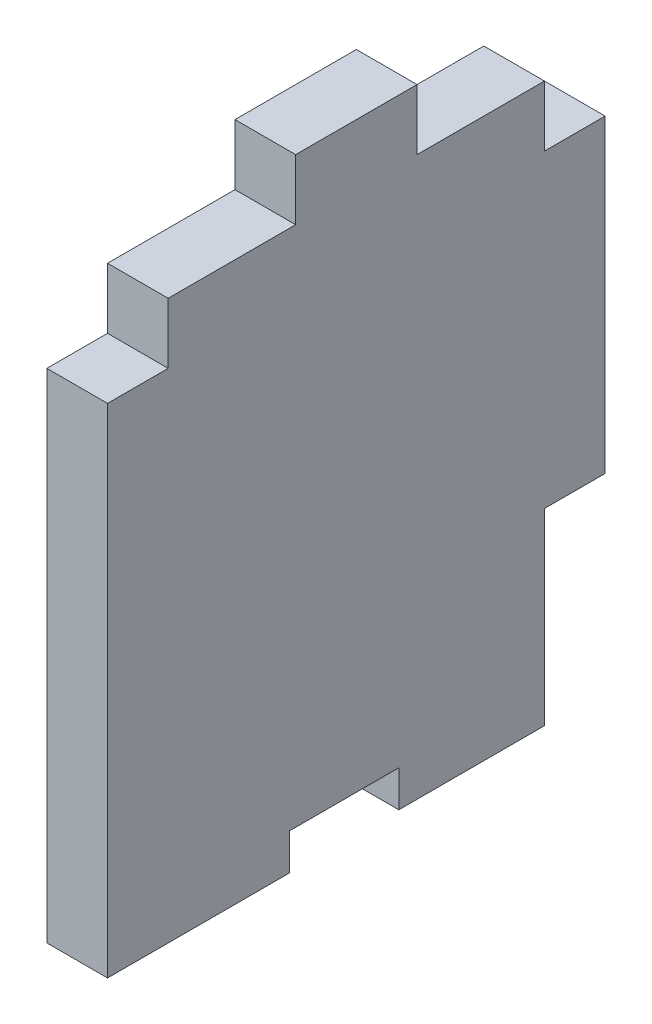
ISO-10303-21;
HEADER;
FILE_DESCRIPTION(('STEP AP214'),'2;1');
FILE_NAME('part.step','',(''),(''),'','','');
FILE_SCHEMA(('AUTOMOTIVE_DESIGN { 1 0 10303 214 1 1 1 1 }'));
ENDSEC;
DATA;
#1=APPLICATION_CONTEXT('core data for automotive mechanical design processes');
#2=APPLICATION_PROTOCOL_DEFINITION('international standard','automotive_design',2000,#1);
#3=PRODUCT_CONTEXT('',#1,'mechanical');
#4=PRODUCT('Part','Part','',(#3));
#5=PRODUCT_RELATED_PRODUCT_CATEGORY('part','',(#4));
#6=PRODUCT_DEFINITION_FORMATION('','',#4);
#7=PRODUCT_DEFINITION_CONTEXT('part definition',#1,'design');
#8=PRODUCT_DEFINITION('design','',#6,#7);
#9=PRODUCT_DEFINITION_SHAPE('','',#8);
#10=(LENGTH_UNIT() NAMED_UNIT(*) SI_UNIT(.MILLI.,.METRE.));
#11=(NAMED_UNIT(*) PLANE_ANGLE_UNIT() SI_UNIT($,.RADIAN.));
#12=(NAMED_UNIT(*) SI_UNIT($,.STERADIAN.) SOLID_ANGLE_UNIT());
#13=UNCERTAINTY_MEASURE_WITH_UNIT(LENGTH_MEASURE(1.E-05),#10,'distance_accuracy_value','');
#14=(GEOMETRIC_REPRESENTATION_CONTEXT(3) GLOBAL_UNCERTAINTY_ASSIGNED_CONTEXT((#13)) GLOBAL_UNIT_ASSIGNED_CONTEXT((#10,
#11,#12)) REPRESENTATION_CONTEXT('',''));
#15=CARTESIAN_POINT('',(0.,0.,0.));
#16=DIRECTION('',(0.,0.,1.));
#17=DIRECTION('',(1.,0.,0.));
#18=AXIS2_PLACEMENT_3D('',#15,#16,#17);
#19=CARTESIAN_POINT('',(5.,-25.5,20.5));
#20=DIRECTION('',(0.,1.,0.));
#21=DIRECTION('',(0.,0.,1.));
#22=AXIS2_PLACEMENT_3D('',#19,#20,#21);
#23=PLANE('',#22);
#24=DIRECTION('',(0.,0.,-1.));
#25=VECTOR('',#24,1.);
#26=CARTESIAN_POINT('',(0.,-25.5,20.5));
#27=LINE('',#26,#25);
#28=CARTESIAN_POINT('',(0.,-25.5,20.5));
#29=VERTEX_POINT('',#28);
#30=CARTESIAN_POINT('',(0.,-25.5,5.50000000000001));
#31=VERTEX_POINT('',#30);
#32=EDGE_CURVE('E175',#29,#31,#27,.T.);
#33=ORIENTED_EDGE('',*,*,#32,.T.);
#34=DIRECTION('',(1.,0.,0.));
#35=VECTOR('',#34,1.);
#36=CARTESIAN_POINT('',(-0.00100000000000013,-25.5,5.50000000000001));
#37=LINE('',#36,#35);
#38=CARTESIAN_POINT('',(5.,-25.5,5.50000000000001));
#39=VERTEX_POINT('',#38);
#40=EDGE_CURVE('E158',#31,#39,#37,.T.);
#41=ORIENTED_EDGE('',*,*,#40,.T.);
#42=DIRECTION('',(0.,0.,-1.));
#43=VECTOR('',#42,1.);
#44=CARTESIAN_POINT('',(5.,-25.5,20.5));
#45=LINE('',#44,#43);
#46=CARTESIAN_POINT('',(5.,-25.5,20.5));
#47=VERTEX_POINT('',#46);
#48=EDGE_CURVE('E41',#47,#39,#45,.T.);
#49=ORIENTED_EDGE('',*,*,#48,.F.);
#50=DIRECTION('',(-1.,0.,0.));
#51=VECTOR('',#50,1.);
#52=CARTESIAN_POINT('',(5.,-25.5,20.5));
#53=LINE('',#52,#51);
#54=EDGE_CURVE('E11',#47,#29,#53,.T.);
#55=ORIENTED_EDGE('',*,*,#54,.T.);
#56=EDGE_LOOP('',(#33,#41,#49,#55));
#57=FACE_BOUND('',#56,.T.);
#58=ADVANCED_FACE('F33',(#57),#23,.F.);
#59=CARTESIAN_POINT('',(5.,25.5,-20.5));
#60=DIRECTION('',(0.,0.,1.));
#61=DIRECTION('',(0.,-1.,0.));
#62=AXIS2_PLACEMENT_3D('',#59,#60,#61);
#63=PLANE('',#62);
#64=DIRECTION('',(0.,1.,0.));
#65=VECTOR('',#64,1.);
#66=CARTESIAN_POINT('',(0.,25.5,-20.5));
#67=LINE('',#66,#65);
#68=CARTESIAN_POINT('',(0.,-10.,-20.5));
#69=VERTEX_POINT('',#68);
#70=CARTESIAN_POINT('',(0.,15.5,-20.5));
#71=VERTEX_POINT('',#70);
#72=EDGE_CURVE('E190',#69,#71,#67,.T.);
#73=ORIENTED_EDGE('',*,*,#72,.T.);
#74=DIRECTION('',(1.,0.,0.));
#75=VECTOR('',#74,1.);
#76=CARTESIAN_POINT('',(-0.00100000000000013,15.5,-20.5));
#77=LINE('',#76,#75);
#78=CARTESIAN_POINT('',(5.,15.5,-20.5));
#79=VERTEX_POINT('',#78);
#80=EDGE_CURVE('E251',#71,#79,#77,.T.);
#81=ORIENTED_EDGE('',*,*,#80,.T.);
#82=DIRECTION('',(0.,1.,0.));
#83=VECTOR('',#82,1.);
#84=CARTESIAN_POINT('',(5.,25.5,-20.5));
#85=LINE('',#84,#83);
#86=CARTESIAN_POINT('',(5.,-10.,-20.5));
#87=VERTEX_POINT('',#86);
#88=EDGE_CURVE('E179',#87,#79,#85,.T.);
#89=ORIENTED_EDGE('',*,*,#88,.F.);
#90=DIRECTION('',(1.,0.,0.));
#91=VECTOR('',#90,1.);
#92=CARTESIAN_POINT('',(-0.00100000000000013,-10.,-20.5));
#93=LINE('',#92,#91);
#94=EDGE_CURVE('E204',#69,#87,#93,.T.);
#95=ORIENTED_EDGE('',*,*,#94,.F.);
#96=EDGE_LOOP('',(#73,#81,#89,#95));
#97=FACE_BOUND('',#96,.T.);
#98=ADVANCED_FACE('F35',(#97),#63,.F.);
#99=CARTESIAN_POINT('',(5.,25.5,20.5));
#100=DIRECTION('',(0.,-1.,0.));
#101=DIRECTION('',(0.,0.,-1.));
#102=AXIS2_PLACEMENT_3D('',#99,#100,#101);
#103=PLANE('',#102);
#104=DIRECTION('',(0.,0.,1.));
#105=VECTOR('',#104,1.);
#106=CARTESIAN_POINT('',(0.,25.5,20.5));
#107=LINE('',#106,#105);
#108=CARTESIAN_POINT('',(0.,25.5,-4.99999999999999));
#109=VERTEX_POINT('',#108);
#110=CARTESIAN_POINT('',(0.,25.5,5.00000000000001));
#111=VERTEX_POINT('',#110);
#112=EDGE_CURVE('E187',#109,#111,#107,.T.);
#113=ORIENTED_EDGE('',*,*,#112,.T.);
#114=DIRECTION('',(1.,0.,0.));
#115=VECTOR('',#114,1.);
#116=CARTESIAN_POINT('',(-0.00100000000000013,25.5,5.00000000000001));
#117=LINE('',#116,#115);
#118=CARTESIAN_POINT('',(5.,25.5,5.00000000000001));
#119=VERTEX_POINT('',#118);
#120=EDGE_CURVE('E235',#111,#119,#117,.T.);
#121=ORIENTED_EDGE('',*,*,#120,.T.);
#122=DIRECTION('',(0.,0.,1.));
#123=VECTOR('',#122,1.);
#124=CARTESIAN_POINT('',(5.,25.5,20.5));
#125=LINE('',#124,#123);
#126=CARTESIAN_POINT('',(5.,25.5,-4.99999999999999));
#127=VERTEX_POINT('',#126);
#128=EDGE_CURVE('E182',#127,#119,#125,.T.);
#129=ORIENTED_EDGE('',*,*,#128,.F.);
#130=DIRECTION('',(1.,0.,0.));
#131=VECTOR('',#130,1.);
#132=CARTESIAN_POINT('',(-0.00100000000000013,25.5,-4.99999999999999));
#133=LINE('',#132,#131);
#134=EDGE_CURVE('E219',#109,#127,#133,.T.);
#135=ORIENTED_EDGE('',*,*,#134,.F.);
#136=EDGE_LOOP('',(#113,#121,#129,#135));
#137=FACE_BOUND('',#136,.T.);
#138=ADVANCED_FACE('F330',(#137),#103,.F.);
#139=CARTESIAN_POINT('',(5.,25.5,20.5));
#140=DIRECTION('',(0.,0.,-1.));
#141=DIRECTION('',(0.,1.,0.));
#142=AXIS2_PLACEMENT_3D('',#139,#140,#141);
#143=PLANE('',#142);
#144=DIRECTION('',(0.,-1.,0.));
#145=VECTOR('',#144,1.);
#146=CARTESIAN_POINT('',(5.,25.5,20.5));
#147=LINE('',#146,#145);
#148=CARTESIAN_POINT('',(5.,15.5,20.5));
#149=VERTEX_POINT('',#148);
#150=EDGE_CURVE('E196',#149,#47,#147,.T.);
#151=ORIENTED_EDGE('',*,*,#150,.F.);
#152=DIRECTION('',(1.,0.,0.));
#153=VECTOR('',#152,1.);
#154=CARTESIAN_POINT('',(-0.00100000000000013,15.5,20.5));
#155=LINE('',#154,#153);
#156=CARTESIAN_POINT('',(0.,15.5,20.5));
#157=VERTEX_POINT('',#156);
#158=EDGE_CURVE('E266',#157,#149,#155,.T.);
#159=ORIENTED_EDGE('',*,*,#158,.F.);
#160=DIRECTION('',(0.,-1.,0.));
#161=VECTOR('',#160,1.);
#162=CARTESIAN_POINT('',(0.,25.5,20.5));
#163=LINE('',#162,#161);
#164=EDGE_CURVE('E184',#157,#29,#163,.T.);
#165=ORIENTED_EDGE('',*,*,#164,.T.);
#166=ORIENTED_EDGE('',*,*,#54,.F.);
#167=EDGE_LOOP('',(#151,#159,#165,#166));
#168=FACE_BOUND('',#167,.T.);
#169=ADVANCED_FACE('F335',(#168),#143,.F.);
#170=CARTESIAN_POINT('',(5.,-25.5,-3.49999999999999));
#171=VERTEX_POINT('',#170);
#172=CARTESIAN_POINT('',(5.,-25.5,-15.5));
#173=VERTEX_POINT('',#172);
#174=EDGE_CURVE('E195',#171,#173,#45,.T.);
#175=ORIENTED_EDGE('',*,*,#174,.F.);
#176=DIRECTION('',(1.,0.,0.));
#177=VECTOR('',#176,1.);
#178=CARTESIAN_POINT('',(-0.00100000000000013,-25.5,-3.49999999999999));
#179=LINE('',#178,#177);
#180=CARTESIAN_POINT('',(0.,-25.5,-3.49999999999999));
#181=VERTEX_POINT('',#180);
#182=EDGE_CURVE('E168',#181,#171,#179,.T.);
#183=ORIENTED_EDGE('',*,*,#182,.F.);
#184=CARTESIAN_POINT('',(0.,-25.5,-15.5));
#185=VERTEX_POINT('',#184);
#186=EDGE_CURVE('E180',#181,#185,#27,.T.);
#187=ORIENTED_EDGE('',*,*,#186,.T.);
#188=DIRECTION('',(1.,0.,0.));
#189=VECTOR('',#188,1.);
#190=CARTESIAN_POINT('',(-0.00100000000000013,-25.5,-15.5));
#191=LINE('',#190,#189);
#192=EDGE_CURVE('E203',#185,#173,#191,.T.);
#193=ORIENTED_EDGE('',*,*,#192,.T.);
#194=EDGE_LOOP('',(#175,#183,#187,#193));
#195=FACE_BOUND('',#194,.T.);
#196=ADVANCED_FACE('F298',(#195),#23,.F.);
#197=CARTESIAN_POINT('',(5.,0.,0.));
#198=DIRECTION('',(1.,0.,0.));
#199=DIRECTION('',(0.,0.,-1.));
#200=AXIS2_PLACEMENT_3D('',#197,#198,#199);
#201=PLANE('',#200);
#202=DIRECTION('',(0.,-1.,0.));
#203=VECTOR('',#202,1.);
#204=CARTESIAN_POINT('',(5.,-25.5,5.50000000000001));
#205=LINE('',#204,#203);
#206=CARTESIAN_POINT('',(5.,-22.5,5.50000000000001));
#207=VERTEX_POINT('',#206);
#208=EDGE_CURVE('E163',#207,#39,#205,.T.);
#209=ORIENTED_EDGE('',*,*,#208,.F.);
#210=DIRECTION('',(0.,0.,1.));
#211=VECTOR('',#210,1.);
#212=CARTESIAN_POINT('',(5.,-22.5,5.50000000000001));
#213=LINE('',#212,#211);
#214=CARTESIAN_POINT('',(5.,-22.5,-3.49999999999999));
#215=VERTEX_POINT('',#214);
#216=EDGE_CURVE('E169',#215,#207,#213,.T.);
#217=ORIENTED_EDGE('',*,*,#216,.F.);
#218=DIRECTION('',(0.,1.,0.));
#219=VECTOR('',#218,1.);
#220=CARTESIAN_POINT('',(5.,-25.5,-3.49999999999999));
#221=LINE('',#220,#219);
#222=EDGE_CURVE('E285',#171,#215,#221,.T.);
#223=ORIENTED_EDGE('',*,*,#222,.F.);
#224=ORIENTED_EDGE('',*,*,#174,.T.);
#225=DIRECTION('',(0.,-1.,0.));
#226=VECTOR('',#225,1.);
#227=CARTESIAN_POINT('',(5.,-25.5,-15.5));
#228=LINE('',#227,#226);
#229=CARTESIAN_POINT('',(5.,-10.,-15.5));
#230=VERTEX_POINT('',#229);
#231=EDGE_CURVE('E207',#230,#173,#228,.T.);
#232=ORIENTED_EDGE('',*,*,#231,.F.);
#233=DIRECTION('',(0.,0.,1.));
#234=VECTOR('',#233,1.);
#235=CARTESIAN_POINT('',(5.,-10.,-20.5));
#236=LINE('',#235,#234);
#237=EDGE_CURVE('E213',#87,#230,#236,.T.);
#238=ORIENTED_EDGE('',*,*,#237,.F.);
#239=ORIENTED_EDGE('',*,*,#88,.T.);
#240=DIRECTION('',(0.,0.,-1.));
#241=VECTOR('',#240,1.);
#242=CARTESIAN_POINT('',(5.,15.5,-20.5));
#243=LINE('',#242,#241);
#244=CARTESIAN_POINT('',(5.,15.5,-15.5));
#245=VERTEX_POINT('',#244);
#246=EDGE_CURVE('E249',#245,#79,#243,.T.);
#247=ORIENTED_EDGE('',*,*,#246,.F.);
#248=DIRECTION('',(0.,-1.,0.));
#249=VECTOR('',#248,1.);
#250=CARTESIAN_POINT('',(5.,20.5,-15.5));
#251=LINE('',#250,#249);
#252=CARTESIAN_POINT('',(5.,20.5,-15.5));
#253=VERTEX_POINT('',#252);
#254=EDGE_CURVE('E256',#253,#245,#251,.T.);
#255=ORIENTED_EDGE('',*,*,#254,.F.);
#256=DIRECTION('',(0.,0.,-1.));
#257=VECTOR('',#256,1.);
#258=CARTESIAN_POINT('',(5.,20.5,-20.5));
#259=LINE('',#258,#257);
#260=CARTESIAN_POINT('',(5.,20.5,-4.99999999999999));
#261=VERTEX_POINT('',#260);
#262=EDGE_CURVE('E222',#261,#253,#259,.T.);
#263=ORIENTED_EDGE('',*,*,#262,.F.);
#264=DIRECTION('',(0.,-1.,0.));
#265=VECTOR('',#264,1.);
#266=CARTESIAN_POINT('',(5.,25.5,-4.99999999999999));
#267=LINE('',#266,#265);
#268=EDGE_CURVE('E227',#127,#261,#267,.T.);
#269=ORIENTED_EDGE('',*,*,#268,.F.);
#270=ORIENTED_EDGE('',*,*,#128,.T.);
#271=DIRECTION('',(0.,1.,0.));
#272=VECTOR('',#271,1.);
#273=CARTESIAN_POINT('',(5.,25.5,5.00000000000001));
#274=LINE('',#273,#272);
#275=CARTESIAN_POINT('',(5.,20.5,5.00000000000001));
#276=VERTEX_POINT('',#275);
#277=EDGE_CURVE('E239',#276,#119,#274,.T.);
#278=ORIENTED_EDGE('',*,*,#277,.F.);
#279=DIRECTION('',(0.,0.,-1.));
#280=VECTOR('',#279,1.);
#281=CARTESIAN_POINT('',(5.,20.5,20.5));
#282=LINE('',#281,#280);
#283=CARTESIAN_POINT('',(5.,20.5,15.5));
#284=VERTEX_POINT('',#283);
#285=EDGE_CURVE('E243',#284,#276,#282,.T.);
#286=ORIENTED_EDGE('',*,*,#285,.F.);
#287=DIRECTION('',(0.,1.,0.));
#288=VECTOR('',#287,1.);
#289=CARTESIAN_POINT('',(5.,20.5,15.5));
#290=LINE('',#289,#288);
#291=CARTESIAN_POINT('',(5.,15.5,15.5));
#292=VERTEX_POINT('',#291);
#293=EDGE_CURVE('E269',#292,#284,#290,.T.);
#294=ORIENTED_EDGE('',*,*,#293,.F.);
#295=DIRECTION('',(0.,0.,-1.));
#296=VECTOR('',#295,1.);
#297=CARTESIAN_POINT('',(5.,15.5,20.5));
#298=LINE('',#297,#296);
#299=EDGE_CURVE('E274',#149,#292,#298,.T.);
#300=ORIENTED_EDGE('',*,*,#299,.F.);
#301=ORIENTED_EDGE('',*,*,#150,.T.);
#302=ORIENTED_EDGE('',*,*,#48,.T.);
#303=EDGE_LOOP('',(#209,#217,#223,#224,#232,#238,#239,#247,#255,#263,#269,#270,#278,#286,#294,
#300,#301,#302));
#304=FACE_BOUND('',#303,.T.);
#305=ADVANCED_FACE('F313',(#304),#201,.T.);
#306=CARTESIAN_POINT('',(0.,0.,0.));
#307=DIRECTION('',(1.,0.,0.));
#308=DIRECTION('',(0.,0.,-1.));
#309=AXIS2_PLACEMENT_3D('',#306,#307,#308);
#310=PLANE('',#309);
#311=DIRECTION('',(0.,0.,-1.));
#312=VECTOR('',#311,1.);
#313=CARTESIAN_POINT('',(0.,-22.5,5.50000000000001));
#314=LINE('',#313,#312);
#315=CARTESIAN_POINT('',(0.,-22.5,5.50000000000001));
#316=VERTEX_POINT('',#315);
#317=CARTESIAN_POINT('',(0.,-22.5,-3.49999999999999));
#318=VERTEX_POINT('',#317);
#319=EDGE_CURVE('E48',#316,#318,#314,.T.);
#320=ORIENTED_EDGE('',*,*,#319,.F.);
#321=DIRECTION('',(0.,1.,0.));
#322=VECTOR('',#321,1.);
#323=CARTESIAN_POINT('',(0.,-25.5,5.50000000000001));
#324=LINE('',#323,#322);
#325=EDGE_CURVE('E161',#31,#316,#324,.T.);
#326=ORIENTED_EDGE('',*,*,#325,.F.);
#327=ORIENTED_EDGE('',*,*,#32,.F.);
#328=ORIENTED_EDGE('',*,*,#164,.F.);
#329=DIRECTION('',(0.,0.,1.));
#330=VECTOR('',#329,1.);
#331=CARTESIAN_POINT('',(0.,15.5,20.5));
#332=LINE('',#331,#330);
#333=CARTESIAN_POINT('',(0.,15.5,15.5));
#334=VERTEX_POINT('',#333);
#335=EDGE_CURVE('E218',#334,#157,#332,.T.);
#336=ORIENTED_EDGE('',*,*,#335,.F.);
#337=DIRECTION('',(0.,-1.,0.));
#338=VECTOR('',#337,1.);
#339=CARTESIAN_POINT('',(0.,20.5,15.5));
#340=LINE('',#339,#338);
#341=CARTESIAN_POINT('',(0.,20.5,15.5));
#342=VERTEX_POINT('',#341);
#343=EDGE_CURVE('E254',#342,#334,#340,.T.);
#344=ORIENTED_EDGE('',*,*,#343,.F.);
#345=DIRECTION('',(0.,0.,1.));
#346=VECTOR('',#345,1.);
#347=CARTESIAN_POINT('',(0.,20.5,20.5));
#348=LINE('',#347,#346);
#349=CARTESIAN_POINT('',(0.,20.5,5.00000000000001));
#350=VERTEX_POINT('',#349);
#351=EDGE_CURVE('E193',#350,#342,#348,.T.);
#352=ORIENTED_EDGE('',*,*,#351,.F.);
#353=DIRECTION('',(0.,-1.,0.));
#354=VECTOR('',#353,1.);
#355=CARTESIAN_POINT('',(0.,25.5,5.00000000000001));
#356=LINE('',#355,#354);
#357=EDGE_CURVE('E224',#111,#350,#356,.T.);
#358=ORIENTED_EDGE('',*,*,#357,.F.);
#359=ORIENTED_EDGE('',*,*,#112,.F.);
#360=DIRECTION('',(0.,1.,0.));
#361=VECTOR('',#360,1.);
#362=CARTESIAN_POINT('',(0.,25.5,-4.99999999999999));
#363=LINE('',#362,#361);
#364=CARTESIAN_POINT('',(0.,20.5,-4.99999999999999));
#365=VERTEX_POINT('',#364);
#366=EDGE_CURVE('E202',#365,#109,#363,.T.);
#367=ORIENTED_EDGE('',*,*,#366,.F.);
#368=DIRECTION('',(0.,0.,1.));
#369=VECTOR('',#368,1.);
#370=CARTESIAN_POINT('',(0.,20.5,-20.5));
#371=LINE('',#370,#369);
#372=CARTESIAN_POINT('',(0.,20.5,-15.5));
#373=VERTEX_POINT('',#372);
#374=EDGE_CURVE('E230',#373,#365,#371,.T.);
#375=ORIENTED_EDGE('',*,*,#374,.F.);
#376=DIRECTION('',(0.,1.,0.));
#377=VECTOR('',#376,1.);
#378=CARTESIAN_POINT('',(0.,20.5,-15.5));
#379=LINE('',#378,#377);
#380=CARTESIAN_POINT('',(0.,15.5,-15.5));
#381=VERTEX_POINT('',#380);
#382=EDGE_CURVE('E56',#381,#373,#379,.T.);
#383=ORIENTED_EDGE('',*,*,#382,.F.);
#384=DIRECTION('',(0.,0.,1.));
#385=VECTOR('',#384,1.);
#386=CARTESIAN_POINT('',(0.,15.5,-20.5));
#387=LINE('',#386,#385);
#388=EDGE_CURVE('E259',#71,#381,#387,.T.);
#389=ORIENTED_EDGE('',*,*,#388,.F.);
#390=ORIENTED_EDGE('',*,*,#72,.F.);
#391=DIRECTION('',(0.,0.,-1.));
#392=VECTOR('',#391,1.);
#393=CARTESIAN_POINT('',(0.,-10.,-20.5));
#394=LINE('',#393,#392);
#395=CARTESIAN_POINT('',(0.,-10.,-15.5));
#396=VERTEX_POINT('',#395);
#397=EDGE_CURVE('E200',#396,#69,#394,.T.);
#398=ORIENTED_EDGE('',*,*,#397,.F.);
#399=DIRECTION('',(0.,1.,0.));
#400=VECTOR('',#399,1.);
#401=CARTESIAN_POINT('',(0.,-25.5,-15.5));
#402=LINE('',#401,#400);
#403=EDGE_CURVE('E216',#185,#396,#402,.T.);
#404=ORIENTED_EDGE('',*,*,#403,.F.);
#405=ORIENTED_EDGE('',*,*,#186,.F.);
#406=DIRECTION('',(0.,-1.,0.));
#407=VECTOR('',#406,1.);
#408=CARTESIAN_POINT('',(0.,-25.5,-3.49999999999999));
#409=LINE('',#408,#407);
#410=EDGE_CURVE('E290',#318,#181,#409,.T.);
#411=ORIENTED_EDGE('',*,*,#410,.F.);
#412=EDGE_LOOP('',(#320,#326,#327,#328,#336,#344,#352,#358,#359,#367,#375,#383,#389,#390,#398,
#404,#405,#411));
#413=FACE_BOUND('',#412,.T.);
#414=ADVANCED_FACE('F173',(#413),#310,.F.);
#415=CARTESIAN_POINT('',(-0.00100000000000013,-25.5,-15.5));
#416=DIRECTION('',(0.,0.,1.));
#417=DIRECTION('',(1.,0.,0.));
#418=AXIS2_PLACEMENT_3D('',#415,#416,#417);
#419=PLANE('',#418);
#420=ORIENTED_EDGE('',*,*,#403,.T.);
#421=DIRECTION('',(1.,0.,0.));
#422=VECTOR('',#421,1.);
#423=CARTESIAN_POINT('',(-0.00100000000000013,-10.,-15.5));
#424=LINE('',#423,#422);
#425=EDGE_CURVE('E206',#396,#230,#424,.T.);
#426=ORIENTED_EDGE('',*,*,#425,.T.);
#427=ORIENTED_EDGE('',*,*,#231,.T.);
#428=ORIENTED_EDGE('',*,*,#192,.F.);
#429=EDGE_LOOP('',(#420,#426,#427,#428));
#430=FACE_BOUND('',#429,.T.);
#431=ADVANCED_FACE('F305',(#430),#419,.F.);
#432=CARTESIAN_POINT('',(-0.00100000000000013,-10.,-20.5));
#433=DIRECTION('',(0.,1.,0.));
#434=DIRECTION('',(0.,0.,1.));
#435=AXIS2_PLACEMENT_3D('',#432,#433,#434);
#436=PLANE('',#435);
#437=ORIENTED_EDGE('',*,*,#397,.T.);
#438=ORIENTED_EDGE('',*,*,#94,.T.);
#439=ORIENTED_EDGE('',*,*,#237,.T.);
#440=ORIENTED_EDGE('',*,*,#425,.F.);
#441=EDGE_LOOP('',(#437,#438,#439,#440));
#442=FACE_BOUND('',#441,.T.);
#443=ADVANCED_FACE('F307',(#442),#436,.F.);
#444=CARTESIAN_POINT('',(-0.00100000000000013,20.5,-20.5));
#445=DIRECTION('',(0.,-1.,0.));
#446=DIRECTION('',(0.,0.,-1.));
#447=AXIS2_PLACEMENT_3D('',#444,#445,#446);
#448=PLANE('',#447);
#449=ORIENTED_EDGE('',*,*,#262,.T.);
#450=DIRECTION('',(1.,0.,0.));
#451=VECTOR('',#450,1.);
#452=CARTESIAN_POINT('',(-0.00100000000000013,20.5,-15.5));
#453=LINE('',#452,#451);
#454=EDGE_CURVE('E246',#373,#253,#453,.T.);
#455=ORIENTED_EDGE('',*,*,#454,.F.);
#456=ORIENTED_EDGE('',*,*,#374,.T.);
#457=DIRECTION('',(1.,0.,0.));
#458=VECTOR('',#457,1.);
#459=CARTESIAN_POINT('',(-0.00100000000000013,20.5,-4.99999999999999));
#460=LINE('',#459,#458);
#461=EDGE_CURVE('E221',#365,#261,#460,.T.);
#462=ORIENTED_EDGE('',*,*,#461,.T.);
#463=EDGE_LOOP('',(#449,#455,#456,#462));
#464=FACE_BOUND('',#463,.T.);
#465=ADVANCED_FACE('F375',(#464),#448,.F.);
#466=CARTESIAN_POINT('',(-0.00100000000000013,25.5,-4.99999999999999));
#467=DIRECTION('',(0.,0.,1.));
#468=DIRECTION('',(0.,-1.,0.));
#469=AXIS2_PLACEMENT_3D('',#466,#467,#468);
#470=PLANE('',#469);
#471=ORIENTED_EDGE('',*,*,#366,.T.);
#472=ORIENTED_EDGE('',*,*,#134,.T.);
#473=ORIENTED_EDGE('',*,*,#268,.T.);
#474=ORIENTED_EDGE('',*,*,#461,.F.);
#475=EDGE_LOOP('',(#471,#472,#473,#474));
#476=FACE_BOUND('',#475,.T.);
#477=ADVANCED_FACE('F373',(#476),#470,.F.);
#478=CARTESIAN_POINT('',(-0.00100000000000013,25.5,5.00000000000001));
#479=DIRECTION('',(0.,0.,-1.));
#480=DIRECTION('',(-1.,0.,0.));
#481=AXIS2_PLACEMENT_3D('',#478,#479,#480);
#482=PLANE('',#481);
#483=ORIENTED_EDGE('',*,*,#357,.T.);
#484=DIRECTION('',(1.,0.,0.));
#485=VECTOR('',#484,1.);
#486=CARTESIAN_POINT('',(-0.00100000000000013,20.5,5.00000000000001));
#487=LINE('',#486,#485);
#488=EDGE_CURVE('E236',#350,#276,#487,.T.);
#489=ORIENTED_EDGE('',*,*,#488,.T.);
#490=ORIENTED_EDGE('',*,*,#277,.T.);
#491=ORIENTED_EDGE('',*,*,#120,.F.);
#492=EDGE_LOOP('',(#483,#489,#490,#491));
#493=FACE_BOUND('',#492,.T.);
#494=ADVANCED_FACE('F363',(#493),#482,.F.);
#495=CARTESIAN_POINT('',(-0.00100000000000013,20.5,20.5));
#496=DIRECTION('',(0.,-1.,0.));
#497=DIRECTION('',(0.,0.,-1.));
#498=AXIS2_PLACEMENT_3D('',#495,#496,#497);
#499=PLANE('',#498);
#500=ORIENTED_EDGE('',*,*,#351,.T.);
#501=DIRECTION('',(1.,0.,0.));
#502=VECTOR('',#501,1.);
#503=CARTESIAN_POINT('',(-0.00100000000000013,20.5,15.5));
#504=LINE('',#503,#502);
#505=EDGE_CURVE('E265',#342,#284,#504,.T.);
#506=ORIENTED_EDGE('',*,*,#505,.T.);
#507=ORIENTED_EDGE('',*,*,#285,.T.);
#508=ORIENTED_EDGE('',*,*,#488,.F.);
#509=EDGE_LOOP('',(#500,#506,#507,#508));
#510=FACE_BOUND('',#509,.T.);
#511=ADVANCED_FACE('F360',(#510),#499,.F.);
#512=CARTESIAN_POINT('',(-0.00100000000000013,20.5,15.5));
#513=DIRECTION('',(0.,0.,-1.));
#514=DIRECTION('',(-1.,0.,0.));
#515=AXIS2_PLACEMENT_3D('',#512,#513,#514);
#516=PLANE('',#515);
#517=ORIENTED_EDGE('',*,*,#343,.T.);
#518=DIRECTION('',(1.,0.,0.));
#519=VECTOR('',#518,1.);
#520=CARTESIAN_POINT('',(-0.00100000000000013,15.5,15.5));
#521=LINE('',#520,#519);
#522=EDGE_CURVE('E268',#334,#292,#521,.T.);
#523=ORIENTED_EDGE('',*,*,#522,.T.);
#524=ORIENTED_EDGE('',*,*,#293,.T.);
#525=ORIENTED_EDGE('',*,*,#505,.F.);
#526=EDGE_LOOP('',(#517,#523,#524,#525));
#527=FACE_BOUND('',#526,.T.);
#528=ADVANCED_FACE('F388',(#527),#516,.F.);
#529=CARTESIAN_POINT('',(-0.00100000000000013,15.5,20.5));
#530=DIRECTION('',(0.,-1.,0.));
#531=DIRECTION('',(0.,0.,-1.));
#532=AXIS2_PLACEMENT_3D('',#529,#530,#531);
#533=PLANE('',#532);
#534=ORIENTED_EDGE('',*,*,#335,.T.);
#535=ORIENTED_EDGE('',*,*,#158,.T.);
#536=ORIENTED_EDGE('',*,*,#299,.T.);
#537=ORIENTED_EDGE('',*,*,#522,.F.);
#538=EDGE_LOOP('',(#534,#535,#536,#537));
#539=FACE_BOUND('',#538,.T.);
#540=ADVANCED_FACE('F352',(#539),#533,.F.);
#541=CARTESIAN_POINT('',(-0.00100000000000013,15.5,-20.5));
#542=DIRECTION('',(0.,-1.,0.));
#543=DIRECTION('',(0.,0.,-1.));
#544=AXIS2_PLACEMENT_3D('',#541,#542,#543);
#545=PLANE('',#544);
#546=ORIENTED_EDGE('',*,*,#388,.T.);
#547=DIRECTION('',(1.,0.,0.));
#548=VECTOR('',#547,1.);
#549=CARTESIAN_POINT('',(-0.00100000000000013,15.5,-15.5));
#550=LINE('',#549,#548);
#551=EDGE_CURVE('E248',#381,#245,#550,.T.);
#552=ORIENTED_EDGE('',*,*,#551,.T.);
#553=ORIENTED_EDGE('',*,*,#246,.T.);
#554=ORIENTED_EDGE('',*,*,#80,.F.);
#555=EDGE_LOOP('',(#546,#552,#553,#554));
#556=FACE_BOUND('',#555,.T.);
#557=ADVANCED_FACE('F379',(#556),#545,.F.);
#558=CARTESIAN_POINT('',(-0.00100000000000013,20.5,-15.5));
#559=DIRECTION('',(0.,0.,1.));
#560=DIRECTION('',(1.,0.,0.));
#561=AXIS2_PLACEMENT_3D('',#558,#559,#560);
#562=PLANE('',#561);
#563=ORIENTED_EDGE('',*,*,#382,.T.);
#564=ORIENTED_EDGE('',*,*,#454,.T.);
#565=ORIENTED_EDGE('',*,*,#254,.T.);
#566=ORIENTED_EDGE('',*,*,#551,.F.);
#567=EDGE_LOOP('',(#563,#564,#565,#566));
#568=FACE_BOUND('',#567,.T.);
#569=ADVANCED_FACE('F323',(#568),#562,.F.);
#570=CARTESIAN_POINT('',(-0.00100000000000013,-25.5,5.50000000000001));
#571=DIRECTION('',(0.,0.,1.));
#572=DIRECTION('',(1.,0.,0.));
#573=AXIS2_PLACEMENT_3D('',#570,#571,#572);
#574=PLANE('',#573);
#575=ORIENTED_EDGE('',*,*,#325,.T.);
#576=DIRECTION('',(1.,0.,0.));
#577=VECTOR('',#576,1.);
#578=CARTESIAN_POINT('',(-0.00100000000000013,-22.5,5.50000000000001));
#579=LINE('',#578,#577);
#580=EDGE_CURVE('E263',#316,#207,#579,.T.);
#581=ORIENTED_EDGE('',*,*,#580,.T.);
#582=ORIENTED_EDGE('',*,*,#208,.T.);
#583=ORIENTED_EDGE('',*,*,#40,.F.);
#584=EDGE_LOOP('',(#575,#581,#582,#583));
#585=FACE_BOUND('',#584,.T.);
#586=ADVANCED_FACE('F160',(#585),#574,.F.);
#587=CARTESIAN_POINT('',(-0.00100000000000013,-22.5,5.50000000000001));
#588=DIRECTION('',(0.,1.,0.));
#589=DIRECTION('',(0.,0.,1.));
#590=AXIS2_PLACEMENT_3D('',#587,#588,#589);
#591=PLANE('',#590);
#592=ORIENTED_EDGE('',*,*,#319,.T.);
#593=DIRECTION('',(1.,0.,0.));
#594=VECTOR('',#593,1.);
#595=CARTESIAN_POINT('',(-0.00100000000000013,-22.5,-3.49999999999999));
#596=LINE('',#595,#594);
#597=EDGE_CURVE('E280',#318,#215,#596,.T.);
#598=ORIENTED_EDGE('',*,*,#597,.T.);
#599=ORIENTED_EDGE('',*,*,#216,.T.);
#600=ORIENTED_EDGE('',*,*,#580,.F.);
#601=EDGE_LOOP('',(#592,#598,#599,#600));
#602=FACE_BOUND('',#601,.T.);
#603=ADVANCED_FACE('F315',(#602),#591,.F.);
#604=CARTESIAN_POINT('',(-0.00100000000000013,-25.5,-3.49999999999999));
#605=DIRECTION('',(0.,0.,-1.));
#606=DIRECTION('',(-1.,0.,0.));
#607=AXIS2_PLACEMENT_3D('',#604,#605,#606);
#608=PLANE('',#607);
#609=ORIENTED_EDGE('',*,*,#410,.T.);
#610=ORIENTED_EDGE('',*,*,#182,.T.);
#611=ORIENTED_EDGE('',*,*,#222,.T.);
#612=ORIENTED_EDGE('',*,*,#597,.F.);
#613=EDGE_LOOP('',(#609,#610,#611,#612));
#614=FACE_BOUND('',#613,.T.);
#615=ADVANCED_FACE('F293',(#614),#608,.F.);
#616=CLOSED_SHELL('',(#58,#98,#138,#169,#196,#305,#414,#431,#443,#465,#477,#494,#511,#528,#540,
#557,#569,#586,#603,#615));
#617=MANIFOLD_SOLID_BREP('B2',#616);
#618=ADVANCED_BREP_SHAPE_REPRESENTATION('',(#18,#617),#14);
#619=SHAPE_DEFINITION_REPRESENTATION(#9,#618);
ENDSEC;
END-ISO-10303-21;
